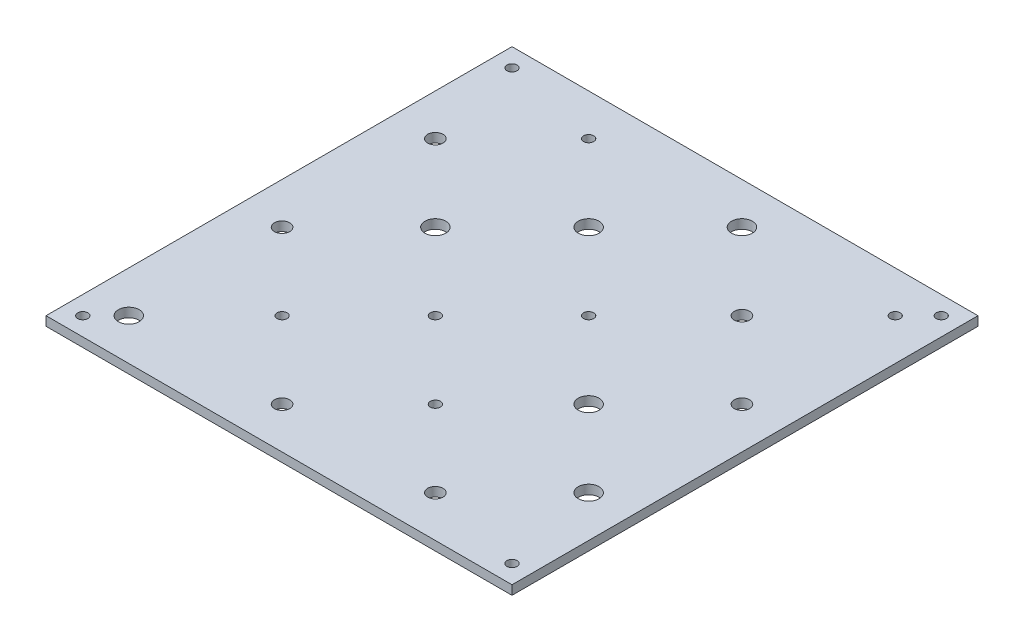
ISO-10303-21;
HEADER;
FILE_DESCRIPTION(('STEP AP214'),'2;1');
FILE_NAME('part.step','',(''),(''),'','','');
FILE_SCHEMA(('AUTOMOTIVE_DESIGN { 1 0 10303 214 1 1 1 1 }'));
ENDSEC;
DATA;
#1=APPLICATION_CONTEXT('core data for automotive mechanical design processes');
#2=APPLICATION_PROTOCOL_DEFINITION('international standard','automotive_design',2000,#1);
#3=PRODUCT_CONTEXT('',#1,'mechanical');
#4=PRODUCT('Part','Part','',(#3));
#5=PRODUCT_RELATED_PRODUCT_CATEGORY('part','',(#4));
#6=PRODUCT_DEFINITION_FORMATION('','',#4);
#7=PRODUCT_DEFINITION_CONTEXT('part definition',#1,'design');
#8=PRODUCT_DEFINITION('design','',#6,#7);
#9=PRODUCT_DEFINITION_SHAPE('','',#8);
#10=(LENGTH_UNIT() NAMED_UNIT(*) SI_UNIT(.MILLI.,.METRE.));
#11=(NAMED_UNIT(*) PLANE_ANGLE_UNIT() SI_UNIT($,.RADIAN.));
#12=(NAMED_UNIT(*) SI_UNIT($,.STERADIAN.) SOLID_ANGLE_UNIT());
#13=UNCERTAINTY_MEASURE_WITH_UNIT(LENGTH_MEASURE(1.E-05),#10,'distance_accuracy_value','');
#14=(GEOMETRIC_REPRESENTATION_CONTEXT(3) GLOBAL_UNCERTAINTY_ASSIGNED_CONTEXT((#13)) GLOBAL_UNIT_ASSIGNED_CONTEXT((#10,
#11,#12)) REPRESENTATION_CONTEXT('',''));
#15=CARTESIAN_POINT('',(0.,0.,0.));
#16=DIRECTION('',(0.,0.,1.));
#17=DIRECTION('',(1.,0.,0.));
#18=AXIS2_PLACEMENT_3D('',#15,#16,#17);
#19=CARTESIAN_POINT('',(76.,3.,76.));
#20=DIRECTION('',(-1.,0.,0.));
#21=DIRECTION('',(0.,0.,1.));
#22=AXIS2_PLACEMENT_3D('',#19,#20,#21);
#23=PLANE('',#22);
#24=DIRECTION('',(0.,0.,-1.));
#25=VECTOR('',#24,1.);
#26=CARTESIAN_POINT('',(76.,0.,76.));
#27=LINE('',#26,#25);
#28=CARTESIAN_POINT('',(76.,0.,76.));
#29=VERTEX_POINT('',#28);
#30=CARTESIAN_POINT('',(76.,0.,-76.));
#31=VERTEX_POINT('',#30);
#32=EDGE_CURVE('E107',#29,#31,#27,.T.);
#33=ORIENTED_EDGE('',*,*,#32,.T.);
#34=DIRECTION('',(0.,-1.,0.));
#35=VECTOR('',#34,1.);
#36=CARTESIAN_POINT('',(76.,3.,-76.));
#37=LINE('',#36,#35);
#38=CARTESIAN_POINT('',(76.,3.,-76.));
#39=VERTEX_POINT('',#38);
#40=EDGE_CURVE('E11',#39,#31,#37,.T.);
#41=ORIENTED_EDGE('',*,*,#40,.F.);
#42=DIRECTION('',(0.,0.,-1.));
#43=VECTOR('',#42,1.);
#44=CARTESIAN_POINT('',(76.,3.,76.));
#45=LINE('',#44,#43);
#46=CARTESIAN_POINT('',(76.,3.,76.));
#47=VERTEX_POINT('',#46);
#48=EDGE_CURVE('E91',#47,#39,#45,.T.);
#49=ORIENTED_EDGE('',*,*,#48,.F.);
#50=DIRECTION('',(0.,-1.,0.));
#51=VECTOR('',#50,1.);
#52=CARTESIAN_POINT('',(76.,3.,76.));
#53=LINE('',#52,#51);
#54=EDGE_CURVE('E103',#47,#29,#53,.T.);
#55=ORIENTED_EDGE('',*,*,#54,.T.);
#56=EDGE_LOOP('',(#33,#41,#49,#55));
#57=FACE_BOUND('',#56,.T.);
#58=ADVANCED_FACE('F39',(#57),#23,.F.);
#59=CARTESIAN_POINT('',(-76.,3.,-76.));
#60=DIRECTION('',(0.,0.,1.));
#61=DIRECTION('',(1.,0.,0.));
#62=AXIS2_PLACEMENT_3D('',#59,#60,#61);
#63=PLANE('',#62);
#64=DIRECTION('',(-1.,0.,0.));
#65=VECTOR('',#64,1.);
#66=CARTESIAN_POINT('',(-76.,0.,-76.));
#67=LINE('',#66,#65);
#68=CARTESIAN_POINT('',(-76.,0.,-76.));
#69=VERTEX_POINT('',#68);
#70=EDGE_CURVE('E96',#31,#69,#67,.T.);
#71=ORIENTED_EDGE('',*,*,#70,.T.);
#72=DIRECTION('',(0.,-1.,0.));
#73=VECTOR('',#72,1.);
#74=CARTESIAN_POINT('',(-76.,3.,-76.));
#75=LINE('',#74,#73);
#76=CARTESIAN_POINT('',(-76.,3.,-76.));
#77=VERTEX_POINT('',#76);
#78=EDGE_CURVE('E48',#77,#69,#75,.T.);
#79=ORIENTED_EDGE('',*,*,#78,.F.);
#80=DIRECTION('',(-1.,0.,0.));
#81=VECTOR('',#80,1.);
#82=CARTESIAN_POINT('',(-76.,3.,-76.));
#83=LINE('',#82,#81);
#84=EDGE_CURVE('E86',#39,#77,#83,.T.);
#85=ORIENTED_EDGE('',*,*,#84,.F.);
#86=ORIENTED_EDGE('',*,*,#40,.T.);
#87=EDGE_LOOP('',(#71,#79,#85,#86));
#88=FACE_BOUND('',#87,.T.);
#89=ADVANCED_FACE('F95',(#88),#63,.F.);
#90=CARTESIAN_POINT('',(-76.,3.,76.));
#91=DIRECTION('',(1.,0.,0.));
#92=DIRECTION('',(0.,0.,-1.));
#93=AXIS2_PLACEMENT_3D('',#90,#91,#92);
#94=PLANE('',#93);
#95=DIRECTION('',(0.,0.,1.));
#96=VECTOR('',#95,1.);
#97=CARTESIAN_POINT('',(-76.,0.,76.));
#98=LINE('',#97,#96);
#99=CARTESIAN_POINT('',(-76.,0.,76.));
#100=VERTEX_POINT('',#99);
#101=EDGE_CURVE('E73',#69,#100,#98,.T.);
#102=ORIENTED_EDGE('',*,*,#101,.T.);
#103=DIRECTION('',(0.,-1.,0.));
#104=VECTOR('',#103,1.);
#105=CARTESIAN_POINT('',(-76.,3.,76.));
#106=LINE('',#105,#104);
#107=CARTESIAN_POINT('',(-76.,3.,76.));
#108=VERTEX_POINT('',#107);
#109=EDGE_CURVE('E98',#108,#100,#106,.T.);
#110=ORIENTED_EDGE('',*,*,#109,.F.);
#111=DIRECTION('',(0.,0.,1.));
#112=VECTOR('',#111,1.);
#113=CARTESIAN_POINT('',(-76.,3.,76.));
#114=LINE('',#113,#112);
#115=EDGE_CURVE('E89',#77,#108,#114,.T.);
#116=ORIENTED_EDGE('',*,*,#115,.F.);
#117=ORIENTED_EDGE('',*,*,#78,.T.);
#118=EDGE_LOOP('',(#102,#110,#116,#117));
#119=FACE_BOUND('',#118,.T.);
#120=ADVANCED_FACE('F99',(#119),#94,.F.);
#121=CARTESIAN_POINT('',(-76.,3.,76.));
#122=DIRECTION('',(0.,0.,-1.));
#123=DIRECTION('',(-1.,0.,0.));
#124=AXIS2_PLACEMENT_3D('',#121,#122,#123);
#125=PLANE('',#124);
#126=DIRECTION('',(1.,0.,0.));
#127=VECTOR('',#126,1.);
#128=CARTESIAN_POINT('',(-76.,0.,76.));
#129=LINE('',#128,#127);
#130=EDGE_CURVE('E79',#100,#29,#129,.T.);
#131=ORIENTED_EDGE('',*,*,#130,.T.);
#132=ORIENTED_EDGE('',*,*,#54,.F.);
#133=DIRECTION('',(1.,0.,0.));
#134=VECTOR('',#133,1.);
#135=CARTESIAN_POINT('',(-76.,3.,76.));
#136=LINE('',#135,#134);
#137=EDGE_CURVE('E56',#108,#47,#136,.T.);
#138=ORIENTED_EDGE('',*,*,#137,.F.);
#139=ORIENTED_EDGE('',*,*,#109,.T.);
#140=EDGE_LOOP('',(#131,#132,#138,#139));
#141=FACE_BOUND('',#140,.T.);
#142=ADVANCED_FACE('F121',(#141),#125,.F.);
#143=CARTESIAN_POINT('',(0.,3.,0.));
#144=DIRECTION('',(0.,-1.,0.));
#145=DIRECTION('',(0.,0.,-1.));
#146=AXIS2_PLACEMENT_3D('',#143,#144,#145);
#147=PLANE('',#146);
#148=CARTESIAN_POINT('',(-70.,3.,-70.));
#149=DIRECTION('',(0.,1.,0.));
#150=DIRECTION('',(0.,0.,1.));
#151=AXIS2_PLACEMENT_3D('',#148,#149,#150);
#152=CIRCLE('',#151,1.65);
#153=CARTESIAN_POINT('',(-70.,3.,-68.35));
#154=VERTEX_POINT('',#153);
#155=EDGE_CURVE('E299',#154,#154,#152,.T.);
#156=ORIENTED_EDGE('',*,*,#155,.F.);
#157=EDGE_LOOP('',(#156));
#158=FACE_BOUND('',#157,.T.);
#159=CARTESIAN_POINT('',(70.,3.,-70.));
#160=DIRECTION('',(0.,1.,0.));
#161=DIRECTION('',(0.,0.,1.));
#162=AXIS2_PLACEMENT_3D('',#159,#160,#161);
#163=CIRCLE('',#162,1.65);
#164=CARTESIAN_POINT('',(70.,3.,-68.35));
#165=VERTEX_POINT('',#164);
#166=EDGE_CURVE('E291',#165,#165,#163,.T.);
#167=ORIENTED_EDGE('',*,*,#166,.F.);
#168=EDGE_LOOP('',(#167));
#169=FACE_BOUND('',#168,.T.);
#170=CARTESIAN_POINT('',(-70.,3.,70.));
#171=DIRECTION('',(0.,1.,0.));
#172=DIRECTION('',(0.,0.,1.));
#173=AXIS2_PLACEMENT_3D('',#170,#171,#172);
#174=CIRCLE('',#173,1.65);
#175=CARTESIAN_POINT('',(-70.,3.,71.65));
#176=VERTEX_POINT('',#175);
#177=EDGE_CURVE('E283',#176,#176,#174,.T.);
#178=ORIENTED_EDGE('',*,*,#177,.F.);
#179=EDGE_LOOP('',(#178));
#180=FACE_BOUND('',#179,.T.);
#181=CARTESIAN_POINT('',(70.,3.,70.));
#182=DIRECTION('',(0.,1.,0.));
#183=DIRECTION('',(0.,0.,1.));
#184=AXIS2_PLACEMENT_3D('',#181,#182,#183);
#185=CIRCLE('',#184,1.65);
#186=CARTESIAN_POINT('',(70.,3.,71.65));
#187=VERTEX_POINT('',#186);
#188=EDGE_CURVE('E275',#187,#187,#185,.T.);
#189=ORIENTED_EDGE('',*,*,#188,.F.);
#190=EDGE_LOOP('',(#189));
#191=FACE_BOUND('',#190,.T.);
#192=CARTESIAN_POINT('',(62.5,3.,37.5));
#193=DIRECTION('',(0.,1.,0.));
#194=DIRECTION('',(0.,0.,1.));
#195=AXIS2_PLACEMENT_3D('',#192,#193,#194);
#196=CIRCLE('',#195,3.4);
#197=CARTESIAN_POINT('',(62.5,3.,40.9));
#198=VERTEX_POINT('',#197);
#199=EDGE_CURVE('E267',#198,#198,#196,.T.);
#200=ORIENTED_EDGE('',*,*,#199,.F.);
#201=EDGE_LOOP('',(#200));
#202=FACE_BOUND('',#201,.T.);
#203=CARTESIAN_POINT('',(37.5,3.,12.5));
#204=DIRECTION('',(0.,1.,0.));
#205=DIRECTION('',(0.,0.,1.));
#206=AXIS2_PLACEMENT_3D('',#203,#204,#205);
#207=CIRCLE('',#206,3.4);
#208=CARTESIAN_POINT('',(37.5,3.,15.9));
#209=VERTEX_POINT('',#208);
#210=EDGE_CURVE('E259',#209,#209,#207,.T.);
#211=ORIENTED_EDGE('',*,*,#210,.F.);
#212=EDGE_LOOP('',(#211));
#213=FACE_BOUND('',#212,.T.);
#214=CARTESIAN_POINT('',(-12.5,3.,-37.5));
#215=DIRECTION('',(0.,1.,0.));
#216=DIRECTION('',(0.,0.,1.));
#217=AXIS2_PLACEMENT_3D('',#214,#215,#216);
#218=CIRCLE('',#217,3.4);
#219=CARTESIAN_POINT('',(-12.5,3.,-34.1));
#220=VERTEX_POINT('',#219);
#221=EDGE_CURVE('E251',#220,#220,#218,.T.);
#222=ORIENTED_EDGE('',*,*,#221,.F.);
#223=EDGE_LOOP('',(#222));
#224=FACE_BOUND('',#223,.T.);
#225=CARTESIAN_POINT('',(12.5,3.,-62.5));
#226=DIRECTION('',(0.,1.,0.));
#227=DIRECTION('',(0.,0.,1.));
#228=AXIS2_PLACEMENT_3D('',#225,#226,#227);
#229=CIRCLE('',#228,3.4);
#230=CARTESIAN_POINT('',(12.5,3.,-59.1));
#231=VERTEX_POINT('',#230);
#232=EDGE_CURVE('E243',#231,#231,#229,.T.);
#233=ORIENTED_EDGE('',*,*,#232,.F.);
#234=EDGE_LOOP('',(#233));
#235=FACE_BOUND('',#234,.T.);
#236=CARTESIAN_POINT('',(-62.5,3.,62.5));
#237=DIRECTION('',(0.,1.,0.));
#238=DIRECTION('',(0.,0.,1.));
#239=AXIS2_PLACEMENT_3D('',#236,#237,#238);
#240=CIRCLE('',#239,3.4);
#241=CARTESIAN_POINT('',(-62.5,3.,65.9));
#242=VERTEX_POINT('',#241);
#243=EDGE_CURVE('E235',#242,#242,#240,.T.);
#244=ORIENTED_EDGE('',*,*,#243,.F.);
#245=EDGE_LOOP('',(#244));
#246=FACE_BOUND('',#245,.T.);
#247=CARTESIAN_POINT('',(-37.5,3.,-12.5));
#248=DIRECTION('',(0.,1.,0.));
#249=DIRECTION('',(0.,0.,1.));
#250=AXIS2_PLACEMENT_3D('',#247,#248,#249);
#251=CIRCLE('',#250,3.4);
#252=CARTESIAN_POINT('',(-37.5,3.,-9.1));
#253=VERTEX_POINT('',#252);
#254=EDGE_CURVE('E227',#253,#253,#251,.T.);
#255=ORIENTED_EDGE('',*,*,#254,.F.);
#256=EDGE_LOOP('',(#255));
#257=FACE_BOUND('',#256,.T.);
#258=CARTESIAN_POINT('',(37.5,3.,-37.5));
#259=DIRECTION('',(0.,1.,0.));
#260=DIRECTION('',(0.,0.,1.));
#261=AXIS2_PLACEMENT_3D('',#258,#259,#260);
#262=CIRCLE('',#261,2.5);
#263=CARTESIAN_POINT('',(37.5,3.,-35.));
#264=VERTEX_POINT('',#263);
#265=EDGE_CURVE('E219',#264,#264,#262,.T.);
#266=ORIENTED_EDGE('',*,*,#265,.F.);
#267=EDGE_LOOP('',(#266));
#268=FACE_BOUND('',#267,.T.);
#269=CARTESIAN_POINT('',(-62.5,3.,-37.5));
#270=DIRECTION('',(0.,1.,0.));
#271=DIRECTION('',(0.,0.,1.));
#272=AXIS2_PLACEMENT_3D('',#269,#270,#271);
#273=CIRCLE('',#272,2.5);
#274=CARTESIAN_POINT('',(-62.5,3.,-35.));
#275=VERTEX_POINT('',#274);
#276=EDGE_CURVE('E211',#275,#275,#273,.T.);
#277=ORIENTED_EDGE('',*,*,#276,.F.);
#278=EDGE_LOOP('',(#277));
#279=FACE_BOUND('',#278,.T.);
#280=CARTESIAN_POINT('',(62.5,3.,-12.5));
#281=DIRECTION('',(0.,1.,0.));
#282=DIRECTION('',(0.,0.,1.));
#283=AXIS2_PLACEMENT_3D('',#280,#281,#282);
#284=CIRCLE('',#283,2.5);
#285=CARTESIAN_POINT('',(62.5,3.,-10.));
#286=VERTEX_POINT('',#285);
#287=EDGE_CURVE('E203',#286,#286,#284,.T.);
#288=ORIENTED_EDGE('',*,*,#287,.F.);
#289=EDGE_LOOP('',(#288));
#290=FACE_BOUND('',#289,.T.);
#291=CARTESIAN_POINT('',(37.5,3.,62.5));
#292=DIRECTION('',(0.,1.,0.));
#293=DIRECTION('',(0.,0.,1.));
#294=AXIS2_PLACEMENT_3D('',#291,#292,#293);
#295=CIRCLE('',#294,2.5);
#296=CARTESIAN_POINT('',(37.5,3.,65.));
#297=VERTEX_POINT('',#296);
#298=EDGE_CURVE('E195',#297,#297,#295,.T.);
#299=ORIENTED_EDGE('',*,*,#298,.F.);
#300=EDGE_LOOP('',(#299));
#301=FACE_BOUND('',#300,.T.);
#302=CARTESIAN_POINT('',(-12.5,3.,62.5));
#303=DIRECTION('',(0.,1.,0.));
#304=DIRECTION('',(0.,0.,1.));
#305=AXIS2_PLACEMENT_3D('',#302,#303,#304);
#306=CIRCLE('',#305,2.5);
#307=CARTESIAN_POINT('',(-12.5,3.,65.));
#308=VERTEX_POINT('',#307);
#309=EDGE_CURVE('E187',#308,#308,#306,.T.);
#310=ORIENTED_EDGE('',*,*,#309,.F.);
#311=EDGE_LOOP('',(#310));
#312=FACE_BOUND('',#311,.T.);
#313=CARTESIAN_POINT('',(-62.5,3.,12.5));
#314=DIRECTION('',(0.,1.,0.));
#315=DIRECTION('',(0.,0.,1.));
#316=AXIS2_PLACEMENT_3D('',#313,#314,#315);
#317=CIRCLE('',#316,2.5);
#318=CARTESIAN_POINT('',(-62.5,3.,15.));
#319=VERTEX_POINT('',#318);
#320=EDGE_CURVE('E179',#319,#319,#317,.T.);
#321=ORIENTED_EDGE('',*,*,#320,.F.);
#322=EDGE_LOOP('',(#321));
#323=FACE_BOUND('',#322,.T.);
#324=CARTESIAN_POINT('',(-37.5,3.,-62.5));
#325=DIRECTION('',(0.,1.,0.));
#326=DIRECTION('',(0.,0.,1.));
#327=AXIS2_PLACEMENT_3D('',#324,#325,#326);
#328=CIRCLE('',#327,1.65);
#329=CARTESIAN_POINT('',(-37.5,3.,-60.85));
#330=VERTEX_POINT('',#329);
#331=EDGE_CURVE('E171',#330,#330,#328,.T.);
#332=ORIENTED_EDGE('',*,*,#331,.F.);
#333=EDGE_LOOP('',(#332));
#334=FACE_BOUND('',#333,.T.);
#335=CARTESIAN_POINT('',(62.5,3.,-62.5));
#336=DIRECTION('',(0.,1.,0.));
#337=DIRECTION('',(0.,0.,1.));
#338=AXIS2_PLACEMENT_3D('',#335,#336,#337);
#339=CIRCLE('',#338,1.65000000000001);
#340=CARTESIAN_POINT('',(62.5,3.,-60.85));
#341=VERTEX_POINT('',#340);
#342=EDGE_CURVE('E163',#341,#341,#339,.T.);
#343=ORIENTED_EDGE('',*,*,#342,.F.);
#344=EDGE_LOOP('',(#343));
#345=FACE_BOUND('',#344,.T.);
#346=CARTESIAN_POINT('',(12.5,3.,-12.5));
#347=DIRECTION('',(0.,1.,0.));
#348=DIRECTION('',(0.,0.,1.));
#349=AXIS2_PLACEMENT_3D('',#346,#347,#348);
#350=CIRCLE('',#349,1.65);
#351=CARTESIAN_POINT('',(12.5,3.,-10.85));
#352=VERTEX_POINT('',#351);
#353=EDGE_CURVE('E155',#352,#352,#350,.T.);
#354=ORIENTED_EDGE('',*,*,#353,.F.);
#355=EDGE_LOOP('',(#354));
#356=FACE_BOUND('',#355,.T.);
#357=CARTESIAN_POINT('',(-37.5,3.,37.5));
#358=DIRECTION('',(0.,1.,0.));
#359=DIRECTION('',(0.,0.,1.));
#360=AXIS2_PLACEMENT_3D('',#357,#358,#359);
#361=CIRCLE('',#360,1.65);
#362=CARTESIAN_POINT('',(-37.5,3.,39.15));
#363=VERTEX_POINT('',#362);
#364=EDGE_CURVE('E147',#363,#363,#361,.T.);
#365=ORIENTED_EDGE('',*,*,#364,.F.);
#366=EDGE_LOOP('',(#365));
#367=FACE_BOUND('',#366,.T.);
#368=CARTESIAN_POINT('',(-12.5,3.,12.5));
#369=DIRECTION('',(0.,1.,0.));
#370=DIRECTION('',(0.,0.,1.));
#371=AXIS2_PLACEMENT_3D('',#368,#369,#370);
#372=CIRCLE('',#371,1.65);
#373=CARTESIAN_POINT('',(-12.5,3.,14.15));
#374=VERTEX_POINT('',#373);
#375=EDGE_CURVE('E139',#374,#374,#372,.T.);
#376=ORIENTED_EDGE('',*,*,#375,.F.);
#377=EDGE_LOOP('',(#376));
#378=FACE_BOUND('',#377,.T.);
#379=CARTESIAN_POINT('',(12.5,3.,37.5));
#380=DIRECTION('',(0.,1.,0.));
#381=DIRECTION('',(0.,0.,1.));
#382=AXIS2_PLACEMENT_3D('',#379,#380,#381);
#383=CIRCLE('',#382,1.65);
#384=CARTESIAN_POINT('',(12.5,3.,39.15));
#385=VERTEX_POINT('',#384);
#386=EDGE_CURVE('E131',#385,#385,#383,.T.);
#387=ORIENTED_EDGE('',*,*,#386,.F.);
#388=EDGE_LOOP('',(#387));
#389=FACE_BOUND('',#388,.T.);
#390=ORIENTED_EDGE('',*,*,#48,.T.);
#391=ORIENTED_EDGE('',*,*,#84,.T.);
#392=ORIENTED_EDGE('',*,*,#115,.T.);
#393=ORIENTED_EDGE('',*,*,#137,.T.);
#394=EDGE_LOOP('',(#390,#391,#392,#393));
#395=FACE_BOUND('',#394,.T.);
#396=ADVANCED_FACE('F87',(#158,#169,#180,#191,#202,#213,#224,#235,#246,#257,#268,#279,#290,#301,
#312,#323,#334,#345,#356,#367,#378,#389,#395),#147,.F.);
#397=CARTESIAN_POINT('',(0.,0.,0.));
#398=DIRECTION('',(0.,-1.,0.));
#399=DIRECTION('',(0.,0.,-1.));
#400=AXIS2_PLACEMENT_3D('',#397,#398,#399);
#401=PLANE('',#400);
#402=CARTESIAN_POINT('',(-70.,0.,-70.));
#403=DIRECTION('',(0.,1.,0.));
#404=DIRECTION('',(0.,0.,1.));
#405=AXIS2_PLACEMENT_3D('',#402,#403,#404);
#406=CIRCLE('',#405,1.65);
#407=CARTESIAN_POINT('',(-70.,0.,-68.35));
#408=VERTEX_POINT('',#407);
#409=EDGE_CURVE('E295',#408,#408,#406,.T.);
#410=ORIENTED_EDGE('',*,*,#409,.T.);
#411=EDGE_LOOP('',(#410));
#412=FACE_BOUND('',#411,.T.);
#413=CARTESIAN_POINT('',(70.,0.,-70.));
#414=DIRECTION('',(0.,1.,0.));
#415=DIRECTION('',(0.,0.,1.));
#416=AXIS2_PLACEMENT_3D('',#413,#414,#415);
#417=CIRCLE('',#416,1.65);
#418=CARTESIAN_POINT('',(70.,0.,-68.35));
#419=VERTEX_POINT('',#418);
#420=EDGE_CURVE('E287',#419,#419,#417,.T.);
#421=ORIENTED_EDGE('',*,*,#420,.T.);
#422=EDGE_LOOP('',(#421));
#423=FACE_BOUND('',#422,.T.);
#424=CARTESIAN_POINT('',(-70.,0.,70.));
#425=DIRECTION('',(0.,1.,0.));
#426=DIRECTION('',(0.,0.,1.));
#427=AXIS2_PLACEMENT_3D('',#424,#425,#426);
#428=CIRCLE('',#427,1.65);
#429=CARTESIAN_POINT('',(-70.,0.,71.65));
#430=VERTEX_POINT('',#429);
#431=EDGE_CURVE('E279',#430,#430,#428,.T.);
#432=ORIENTED_EDGE('',*,*,#431,.T.);
#433=EDGE_LOOP('',(#432));
#434=FACE_BOUND('',#433,.T.);
#435=CARTESIAN_POINT('',(70.,0.,70.));
#436=DIRECTION('',(0.,1.,0.));
#437=DIRECTION('',(0.,0.,1.));
#438=AXIS2_PLACEMENT_3D('',#435,#436,#437);
#439=CIRCLE('',#438,1.65);
#440=CARTESIAN_POINT('',(70.,0.,71.65));
#441=VERTEX_POINT('',#440);
#442=EDGE_CURVE('E271',#441,#441,#439,.T.);
#443=ORIENTED_EDGE('',*,*,#442,.T.);
#444=EDGE_LOOP('',(#443));
#445=FACE_BOUND('',#444,.T.);
#446=CARTESIAN_POINT('',(62.5,0.,37.5));
#447=DIRECTION('',(0.,1.,0.));
#448=DIRECTION('',(0.,0.,1.));
#449=AXIS2_PLACEMENT_3D('',#446,#447,#448);
#450=CIRCLE('',#449,3.4);
#451=CARTESIAN_POINT('',(62.5,0.,40.9));
#452=VERTEX_POINT('',#451);
#453=EDGE_CURVE('E263',#452,#452,#450,.T.);
#454=ORIENTED_EDGE('',*,*,#453,.T.);
#455=EDGE_LOOP('',(#454));
#456=FACE_BOUND('',#455,.T.);
#457=CARTESIAN_POINT('',(37.5,0.,12.5));
#458=DIRECTION('',(0.,1.,0.));
#459=DIRECTION('',(0.,0.,1.));
#460=AXIS2_PLACEMENT_3D('',#457,#458,#459);
#461=CIRCLE('',#460,3.4);
#462=CARTESIAN_POINT('',(37.5,0.,15.9));
#463=VERTEX_POINT('',#462);
#464=EDGE_CURVE('E255',#463,#463,#461,.T.);
#465=ORIENTED_EDGE('',*,*,#464,.T.);
#466=EDGE_LOOP('',(#465));
#467=FACE_BOUND('',#466,.T.);
#468=CARTESIAN_POINT('',(-12.5,0.,-37.5));
#469=DIRECTION('',(0.,1.,0.));
#470=DIRECTION('',(0.,0.,1.));
#471=AXIS2_PLACEMENT_3D('',#468,#469,#470);
#472=CIRCLE('',#471,3.4);
#473=CARTESIAN_POINT('',(-12.5,0.,-34.1));
#474=VERTEX_POINT('',#473);
#475=EDGE_CURVE('E247',#474,#474,#472,.T.);
#476=ORIENTED_EDGE('',*,*,#475,.T.);
#477=EDGE_LOOP('',(#476));
#478=FACE_BOUND('',#477,.T.);
#479=CARTESIAN_POINT('',(12.5,0.,-62.5));
#480=DIRECTION('',(0.,1.,0.));
#481=DIRECTION('',(0.,0.,1.));
#482=AXIS2_PLACEMENT_3D('',#479,#480,#481);
#483=CIRCLE('',#482,3.4);
#484=CARTESIAN_POINT('',(12.5,0.,-59.1));
#485=VERTEX_POINT('',#484);
#486=EDGE_CURVE('E239',#485,#485,#483,.T.);
#487=ORIENTED_EDGE('',*,*,#486,.T.);
#488=EDGE_LOOP('',(#487));
#489=FACE_BOUND('',#488,.T.);
#490=CARTESIAN_POINT('',(-62.5,0.,62.5));
#491=DIRECTION('',(0.,1.,0.));
#492=DIRECTION('',(0.,0.,1.));
#493=AXIS2_PLACEMENT_3D('',#490,#491,#492);
#494=CIRCLE('',#493,3.4);
#495=CARTESIAN_POINT('',(-62.5,0.,65.9));
#496=VERTEX_POINT('',#495);
#497=EDGE_CURVE('E231',#496,#496,#494,.T.);
#498=ORIENTED_EDGE('',*,*,#497,.T.);
#499=EDGE_LOOP('',(#498));
#500=FACE_BOUND('',#499,.T.);
#501=CARTESIAN_POINT('',(-37.5,0.,-12.5));
#502=DIRECTION('',(0.,1.,0.));
#503=DIRECTION('',(0.,0.,1.));
#504=AXIS2_PLACEMENT_3D('',#501,#502,#503);
#505=CIRCLE('',#504,3.4);
#506=CARTESIAN_POINT('',(-37.5,0.,-9.1));
#507=VERTEX_POINT('',#506);
#508=EDGE_CURVE('E223',#507,#507,#505,.T.);
#509=ORIENTED_EDGE('',*,*,#508,.T.);
#510=EDGE_LOOP('',(#509));
#511=FACE_BOUND('',#510,.T.);
#512=CARTESIAN_POINT('',(37.5,0.,-37.5));
#513=DIRECTION('',(0.,1.,0.));
#514=DIRECTION('',(0.,0.,1.));
#515=AXIS2_PLACEMENT_3D('',#512,#513,#514);
#516=CIRCLE('',#515,2.5);
#517=CARTESIAN_POINT('',(37.5,0.,-35.));
#518=VERTEX_POINT('',#517);
#519=EDGE_CURVE('E215',#518,#518,#516,.T.);
#520=ORIENTED_EDGE('',*,*,#519,.T.);
#521=EDGE_LOOP('',(#520));
#522=FACE_BOUND('',#521,.T.);
#523=CARTESIAN_POINT('',(-62.5,0.,-37.5));
#524=DIRECTION('',(0.,1.,0.));
#525=DIRECTION('',(0.,0.,1.));
#526=AXIS2_PLACEMENT_3D('',#523,#524,#525);
#527=CIRCLE('',#526,2.5);
#528=CARTESIAN_POINT('',(-62.5,0.,-35.));
#529=VERTEX_POINT('',#528);
#530=EDGE_CURVE('E207',#529,#529,#527,.T.);
#531=ORIENTED_EDGE('',*,*,#530,.T.);
#532=EDGE_LOOP('',(#531));
#533=FACE_BOUND('',#532,.T.);
#534=CARTESIAN_POINT('',(62.5,0.,-12.5));
#535=DIRECTION('',(0.,1.,0.));
#536=DIRECTION('',(0.,0.,1.));
#537=AXIS2_PLACEMENT_3D('',#534,#535,#536);
#538=CIRCLE('',#537,2.5);
#539=CARTESIAN_POINT('',(62.5,0.,-10.));
#540=VERTEX_POINT('',#539);
#541=EDGE_CURVE('E199',#540,#540,#538,.T.);
#542=ORIENTED_EDGE('',*,*,#541,.T.);
#543=EDGE_LOOP('',(#542));
#544=FACE_BOUND('',#543,.T.);
#545=CARTESIAN_POINT('',(37.5,0.,62.5));
#546=DIRECTION('',(0.,1.,0.));
#547=DIRECTION('',(0.,0.,1.));
#548=AXIS2_PLACEMENT_3D('',#545,#546,#547);
#549=CIRCLE('',#548,2.5);
#550=CARTESIAN_POINT('',(37.5,0.,65.));
#551=VERTEX_POINT('',#550);
#552=EDGE_CURVE('E191',#551,#551,#549,.T.);
#553=ORIENTED_EDGE('',*,*,#552,.T.);
#554=EDGE_LOOP('',(#553));
#555=FACE_BOUND('',#554,.T.);
#556=CARTESIAN_POINT('',(-12.5,0.,62.5));
#557=DIRECTION('',(0.,1.,0.));
#558=DIRECTION('',(0.,0.,1.));
#559=AXIS2_PLACEMENT_3D('',#556,#557,#558);
#560=CIRCLE('',#559,2.5);
#561=CARTESIAN_POINT('',(-12.5,0.,65.));
#562=VERTEX_POINT('',#561);
#563=EDGE_CURVE('E183',#562,#562,#560,.T.);
#564=ORIENTED_EDGE('',*,*,#563,.T.);
#565=EDGE_LOOP('',(#564));
#566=FACE_BOUND('',#565,.T.);
#567=CARTESIAN_POINT('',(-62.5,0.,12.5));
#568=DIRECTION('',(0.,1.,0.));
#569=DIRECTION('',(0.,0.,1.));
#570=AXIS2_PLACEMENT_3D('',#567,#568,#569);
#571=CIRCLE('',#570,2.5);
#572=CARTESIAN_POINT('',(-62.5,0.,15.));
#573=VERTEX_POINT('',#572);
#574=EDGE_CURVE('E175',#573,#573,#571,.T.);
#575=ORIENTED_EDGE('',*,*,#574,.T.);
#576=EDGE_LOOP('',(#575));
#577=FACE_BOUND('',#576,.T.);
#578=CARTESIAN_POINT('',(-37.5,0.,-62.5));
#579=DIRECTION('',(0.,1.,0.));
#580=DIRECTION('',(0.,0.,1.));
#581=AXIS2_PLACEMENT_3D('',#578,#579,#580);
#582=CIRCLE('',#581,1.65);
#583=CARTESIAN_POINT('',(-37.5,0.,-60.85));
#584=VERTEX_POINT('',#583);
#585=EDGE_CURVE('E167',#584,#584,#582,.T.);
#586=ORIENTED_EDGE('',*,*,#585,.T.);
#587=EDGE_LOOP('',(#586));
#588=FACE_BOUND('',#587,.T.);
#589=CARTESIAN_POINT('',(62.5,0.,-62.5));
#590=DIRECTION('',(0.,1.,0.));
#591=DIRECTION('',(0.,0.,1.));
#592=AXIS2_PLACEMENT_3D('',#589,#590,#591);
#593=CIRCLE('',#592,1.65000000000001);
#594=CARTESIAN_POINT('',(62.5,0.,-60.85));
#595=VERTEX_POINT('',#594);
#596=EDGE_CURVE('E159',#595,#595,#593,.T.);
#597=ORIENTED_EDGE('',*,*,#596,.T.);
#598=EDGE_LOOP('',(#597));
#599=FACE_BOUND('',#598,.T.);
#600=CARTESIAN_POINT('',(12.5,0.,-12.5));
#601=DIRECTION('',(0.,1.,0.));
#602=DIRECTION('',(0.,0.,1.));
#603=AXIS2_PLACEMENT_3D('',#600,#601,#602);
#604=CIRCLE('',#603,1.65);
#605=CARTESIAN_POINT('',(12.5,0.,-10.85));
#606=VERTEX_POINT('',#605);
#607=EDGE_CURVE('E151',#606,#606,#604,.T.);
#608=ORIENTED_EDGE('',*,*,#607,.T.);
#609=EDGE_LOOP('',(#608));
#610=FACE_BOUND('',#609,.T.);
#611=CARTESIAN_POINT('',(-37.5,0.,37.5));
#612=DIRECTION('',(0.,1.,0.));
#613=DIRECTION('',(0.,0.,1.));
#614=AXIS2_PLACEMENT_3D('',#611,#612,#613);
#615=CIRCLE('',#614,1.65);
#616=CARTESIAN_POINT('',(-37.5,0.,39.15));
#617=VERTEX_POINT('',#616);
#618=EDGE_CURVE('E143',#617,#617,#615,.T.);
#619=ORIENTED_EDGE('',*,*,#618,.T.);
#620=EDGE_LOOP('',(#619));
#621=FACE_BOUND('',#620,.T.);
#622=CARTESIAN_POINT('',(-12.5,0.,12.5));
#623=DIRECTION('',(0.,1.,0.));
#624=DIRECTION('',(0.,0.,1.));
#625=AXIS2_PLACEMENT_3D('',#622,#623,#624);
#626=CIRCLE('',#625,1.65);
#627=CARTESIAN_POINT('',(-12.5,0.,14.15));
#628=VERTEX_POINT('',#627);
#629=EDGE_CURVE('E135',#628,#628,#626,.T.);
#630=ORIENTED_EDGE('',*,*,#629,.T.);
#631=EDGE_LOOP('',(#630));
#632=FACE_BOUND('',#631,.T.);
#633=CARTESIAN_POINT('',(12.5,0.,37.5));
#634=DIRECTION('',(0.,1.,0.));
#635=DIRECTION('',(0.,0.,1.));
#636=AXIS2_PLACEMENT_3D('',#633,#634,#635);
#637=CIRCLE('',#636,1.65);
#638=CARTESIAN_POINT('',(12.5,0.,39.15));
#639=VERTEX_POINT('',#638);
#640=EDGE_CURVE('E111',#639,#639,#637,.T.);
#641=ORIENTED_EDGE('',*,*,#640,.T.);
#642=EDGE_LOOP('',(#641));
#643=FACE_BOUND('',#642,.T.);
#644=ORIENTED_EDGE('',*,*,#32,.F.);
#645=ORIENTED_EDGE('',*,*,#130,.F.);
#646=ORIENTED_EDGE('',*,*,#101,.F.);
#647=ORIENTED_EDGE('',*,*,#70,.F.);
#648=EDGE_LOOP('',(#644,#645,#646,#647));
#649=FACE_BOUND('',#648,.T.);
#650=ADVANCED_FACE('F124',(#412,#423,#434,#445,#456,#467,#478,#489,#500,#511,#522,#533,#544,
#555,#566,#577,#588,#599,#610,#621,#632,#643,#649),#401,.T.);
#651=CARTESIAN_POINT('',(12.5,3.,37.5));
#652=DIRECTION('',(0.,1.,0.));
#653=DIRECTION('',(0.,0.,1.));
#654=AXIS2_PLACEMENT_3D('',#651,#652,#653);
#655=CYLINDRICAL_SURFACE('',#654,1.65);
#656=ORIENTED_EDGE('',*,*,#640,.F.);
#657=EDGE_LOOP('',(#656));
#658=FACE_BOUND('',#657,.T.);
#659=ORIENTED_EDGE('',*,*,#386,.T.);
#660=EDGE_LOOP('',(#659));
#661=FACE_BOUND('',#660,.T.);
#662=ADVANCED_FACE('F351',(#658,#661),#655,.F.);
#663=CARTESIAN_POINT('',(-12.5,3.,12.5));
#664=DIRECTION('',(0.,1.,0.));
#665=DIRECTION('',(0.,0.,1.));
#666=AXIS2_PLACEMENT_3D('',#663,#664,#665);
#667=CYLINDRICAL_SURFACE('',#666,1.65);
#668=ORIENTED_EDGE('',*,*,#629,.F.);
#669=EDGE_LOOP('',(#668));
#670=FACE_BOUND('',#669,.T.);
#671=ORIENTED_EDGE('',*,*,#375,.T.);
#672=EDGE_LOOP('',(#671));
#673=FACE_BOUND('',#672,.T.);
#674=ADVANCED_FACE('F353',(#670,#673),#667,.F.);
#675=CARTESIAN_POINT('',(-37.5,3.,37.5));
#676=DIRECTION('',(0.,1.,0.));
#677=DIRECTION('',(0.,0.,1.));
#678=AXIS2_PLACEMENT_3D('',#675,#676,#677);
#679=CYLINDRICAL_SURFACE('',#678,1.65);
#680=ORIENTED_EDGE('',*,*,#618,.F.);
#681=EDGE_LOOP('',(#680));
#682=FACE_BOUND('',#681,.T.);
#683=ORIENTED_EDGE('',*,*,#364,.T.);
#684=EDGE_LOOP('',(#683));
#685=FACE_BOUND('',#684,.T.);
#686=ADVANCED_FACE('F360',(#682,#685),#679,.F.);
#687=CARTESIAN_POINT('',(12.5,3.,-12.5));
#688=DIRECTION('',(0.,1.,0.));
#689=DIRECTION('',(0.,0.,1.));
#690=AXIS2_PLACEMENT_3D('',#687,#688,#689);
#691=CYLINDRICAL_SURFACE('',#690,1.65);
#692=ORIENTED_EDGE('',*,*,#607,.F.);
#693=EDGE_LOOP('',(#692));
#694=FACE_BOUND('',#693,.T.);
#695=ORIENTED_EDGE('',*,*,#353,.T.);
#696=EDGE_LOOP('',(#695));
#697=FACE_BOUND('',#696,.T.);
#698=ADVANCED_FACE('F491',(#694,#697),#691,.F.);
#699=CARTESIAN_POINT('',(62.5,3.,-62.5));
#700=DIRECTION('',(0.,1.,0.));
#701=DIRECTION('',(0.,0.,1.));
#702=AXIS2_PLACEMENT_3D('',#699,#700,#701);
#703=CYLINDRICAL_SURFACE('',#702,1.65000000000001);
#704=ORIENTED_EDGE('',*,*,#596,.F.);
#705=EDGE_LOOP('',(#704));
#706=FACE_BOUND('',#705,.T.);
#707=ORIENTED_EDGE('',*,*,#342,.T.);
#708=EDGE_LOOP('',(#707));
#709=FACE_BOUND('',#708,.T.);
#710=ADVANCED_FACE('F487',(#706,#709),#703,.F.);
#711=CARTESIAN_POINT('',(-37.5,3.,-62.5));
#712=DIRECTION('',(0.,1.,0.));
#713=DIRECTION('',(0.,0.,1.));
#714=AXIS2_PLACEMENT_3D('',#711,#712,#713);
#715=CYLINDRICAL_SURFACE('',#714,1.65);
#716=ORIENTED_EDGE('',*,*,#585,.F.);
#717=EDGE_LOOP('',(#716));
#718=FACE_BOUND('',#717,.T.);
#719=ORIENTED_EDGE('',*,*,#331,.T.);
#720=EDGE_LOOP('',(#719));
#721=FACE_BOUND('',#720,.T.);
#722=ADVANCED_FACE('F483',(#718,#721),#715,.F.);
#723=CARTESIAN_POINT('',(-62.5,3.,12.5));
#724=DIRECTION('',(0.,1.,0.));
#725=DIRECTION('',(0.,0.,1.));
#726=AXIS2_PLACEMENT_3D('',#723,#724,#725);
#727=CYLINDRICAL_SURFACE('',#726,2.5);
#728=ORIENTED_EDGE('',*,*,#574,.F.);
#729=EDGE_LOOP('',(#728));
#730=FACE_BOUND('',#729,.T.);
#731=ORIENTED_EDGE('',*,*,#320,.T.);
#732=EDGE_LOOP('',(#731));
#733=FACE_BOUND('',#732,.T.);
#734=ADVANCED_FACE('F479',(#730,#733),#727,.F.);
#735=CARTESIAN_POINT('',(-12.5,3.,62.5));
#736=DIRECTION('',(0.,1.,0.));
#737=DIRECTION('',(0.,0.,1.));
#738=AXIS2_PLACEMENT_3D('',#735,#736,#737);
#739=CYLINDRICAL_SURFACE('',#738,2.5);
#740=ORIENTED_EDGE('',*,*,#563,.F.);
#741=EDGE_LOOP('',(#740));
#742=FACE_BOUND('',#741,.T.);
#743=ORIENTED_EDGE('',*,*,#309,.T.);
#744=EDGE_LOOP('',(#743));
#745=FACE_BOUND('',#744,.T.);
#746=ADVANCED_FACE('F475',(#742,#745),#739,.F.);
#747=CARTESIAN_POINT('',(37.5,3.,62.5));
#748=DIRECTION('',(0.,1.,0.));
#749=DIRECTION('',(0.,0.,1.));
#750=AXIS2_PLACEMENT_3D('',#747,#748,#749);
#751=CYLINDRICAL_SURFACE('',#750,2.5);
#752=ORIENTED_EDGE('',*,*,#552,.F.);
#753=EDGE_LOOP('',(#752));
#754=FACE_BOUND('',#753,.T.);
#755=ORIENTED_EDGE('',*,*,#298,.T.);
#756=EDGE_LOOP('',(#755));
#757=FACE_BOUND('',#756,.T.);
#758=ADVANCED_FACE('F471',(#754,#757),#751,.F.);
#759=CARTESIAN_POINT('',(62.5,3.,-12.5));
#760=DIRECTION('',(0.,1.,0.));
#761=DIRECTION('',(0.,0.,1.));
#762=AXIS2_PLACEMENT_3D('',#759,#760,#761);
#763=CYLINDRICAL_SURFACE('',#762,2.5);
#764=ORIENTED_EDGE('',*,*,#541,.F.);
#765=EDGE_LOOP('',(#764));
#766=FACE_BOUND('',#765,.T.);
#767=ORIENTED_EDGE('',*,*,#287,.T.);
#768=EDGE_LOOP('',(#767));
#769=FACE_BOUND('',#768,.T.);
#770=ADVANCED_FACE('F467',(#766,#769),#763,.F.);
#771=CARTESIAN_POINT('',(-62.5,3.,-37.5));
#772=DIRECTION('',(0.,1.,0.));
#773=DIRECTION('',(0.,0.,1.));
#774=AXIS2_PLACEMENT_3D('',#771,#772,#773);
#775=CYLINDRICAL_SURFACE('',#774,2.5);
#776=ORIENTED_EDGE('',*,*,#530,.F.);
#777=EDGE_LOOP('',(#776));
#778=FACE_BOUND('',#777,.T.);
#779=ORIENTED_EDGE('',*,*,#276,.T.);
#780=EDGE_LOOP('',(#779));
#781=FACE_BOUND('',#780,.T.);
#782=ADVANCED_FACE('F463',(#778,#781),#775,.F.);
#783=CARTESIAN_POINT('',(37.5,3.,-37.5));
#784=DIRECTION('',(0.,1.,0.));
#785=DIRECTION('',(0.,0.,1.));
#786=AXIS2_PLACEMENT_3D('',#783,#784,#785);
#787=CYLINDRICAL_SURFACE('',#786,2.5);
#788=ORIENTED_EDGE('',*,*,#519,.F.);
#789=EDGE_LOOP('',(#788));
#790=FACE_BOUND('',#789,.T.);
#791=ORIENTED_EDGE('',*,*,#265,.T.);
#792=EDGE_LOOP('',(#791));
#793=FACE_BOUND('',#792,.T.);
#794=ADVANCED_FACE('F459',(#790,#793),#787,.F.);
#795=CARTESIAN_POINT('',(-37.5,3.,-12.5));
#796=DIRECTION('',(0.,1.,0.));
#797=DIRECTION('',(0.,0.,1.));
#798=AXIS2_PLACEMENT_3D('',#795,#796,#797);
#799=CYLINDRICAL_SURFACE('',#798,3.4);
#800=ORIENTED_EDGE('',*,*,#508,.F.);
#801=EDGE_LOOP('',(#800));
#802=FACE_BOUND('',#801,.T.);
#803=ORIENTED_EDGE('',*,*,#254,.T.);
#804=EDGE_LOOP('',(#803));
#805=FACE_BOUND('',#804,.T.);
#806=ADVANCED_FACE('F455',(#802,#805),#799,.F.);
#807=CARTESIAN_POINT('',(-62.5,3.,62.5));
#808=DIRECTION('',(0.,1.,0.));
#809=DIRECTION('',(0.,0.,1.));
#810=AXIS2_PLACEMENT_3D('',#807,#808,#809);
#811=CYLINDRICAL_SURFACE('',#810,3.4);
#812=ORIENTED_EDGE('',*,*,#497,.F.);
#813=EDGE_LOOP('',(#812));
#814=FACE_BOUND('',#813,.T.);
#815=ORIENTED_EDGE('',*,*,#243,.T.);
#816=EDGE_LOOP('',(#815));
#817=FACE_BOUND('',#816,.T.);
#818=ADVANCED_FACE('F451',(#814,#817),#811,.F.);
#819=CARTESIAN_POINT('',(12.5,3.,-62.5));
#820=DIRECTION('',(0.,1.,0.));
#821=DIRECTION('',(0.,0.,1.));
#822=AXIS2_PLACEMENT_3D('',#819,#820,#821);
#823=CYLINDRICAL_SURFACE('',#822,3.4);
#824=ORIENTED_EDGE('',*,*,#486,.F.);
#825=EDGE_LOOP('',(#824));
#826=FACE_BOUND('',#825,.T.);
#827=ORIENTED_EDGE('',*,*,#232,.T.);
#828=EDGE_LOOP('',(#827));
#829=FACE_BOUND('',#828,.T.);
#830=ADVANCED_FACE('F447',(#826,#829),#823,.F.);
#831=CARTESIAN_POINT('',(-12.5,3.,-37.5));
#832=DIRECTION('',(0.,1.,0.));
#833=DIRECTION('',(0.,0.,1.));
#834=AXIS2_PLACEMENT_3D('',#831,#832,#833);
#835=CYLINDRICAL_SURFACE('',#834,3.4);
#836=ORIENTED_EDGE('',*,*,#475,.F.);
#837=EDGE_LOOP('',(#836));
#838=FACE_BOUND('',#837,.T.);
#839=ORIENTED_EDGE('',*,*,#221,.T.);
#840=EDGE_LOOP('',(#839));
#841=FACE_BOUND('',#840,.T.);
#842=ADVANCED_FACE('F443',(#838,#841),#835,.F.);
#843=CARTESIAN_POINT('',(37.5,3.,12.5));
#844=DIRECTION('',(0.,1.,0.));
#845=DIRECTION('',(0.,0.,1.));
#846=AXIS2_PLACEMENT_3D('',#843,#844,#845);
#847=CYLINDRICAL_SURFACE('',#846,3.4);
#848=ORIENTED_EDGE('',*,*,#464,.F.);
#849=EDGE_LOOP('',(#848));
#850=FACE_BOUND('',#849,.T.);
#851=ORIENTED_EDGE('',*,*,#210,.T.);
#852=EDGE_LOOP('',(#851));
#853=FACE_BOUND('',#852,.T.);
#854=ADVANCED_FACE('F439',(#850,#853),#847,.F.);
#855=CARTESIAN_POINT('',(62.5,3.,37.5));
#856=DIRECTION('',(0.,1.,0.));
#857=DIRECTION('',(0.,0.,1.));
#858=AXIS2_PLACEMENT_3D('',#855,#856,#857);
#859=CYLINDRICAL_SURFACE('',#858,3.4);
#860=ORIENTED_EDGE('',*,*,#453,.F.);
#861=EDGE_LOOP('',(#860));
#862=FACE_BOUND('',#861,.T.);
#863=ORIENTED_EDGE('',*,*,#199,.T.);
#864=EDGE_LOOP('',(#863));
#865=FACE_BOUND('',#864,.T.);
#866=ADVANCED_FACE('F401',(#862,#865),#859,.F.);
#867=CARTESIAN_POINT('',(70.,3.,70.));
#868=DIRECTION('',(0.,1.,0.));
#869=DIRECTION('',(0.,0.,1.));
#870=AXIS2_PLACEMENT_3D('',#867,#868,#869);
#871=CYLINDRICAL_SURFACE('',#870,1.65);
#872=ORIENTED_EDGE('',*,*,#442,.F.);
#873=EDGE_LOOP('',(#872));
#874=FACE_BOUND('',#873,.T.);
#875=ORIENTED_EDGE('',*,*,#188,.T.);
#876=EDGE_LOOP('',(#875));
#877=FACE_BOUND('',#876,.T.);
#878=ADVANCED_FACE('F395',(#874,#877),#871,.F.);
#879=CARTESIAN_POINT('',(-70.,3.,70.));
#880=DIRECTION('',(0.,1.,0.));
#881=DIRECTION('',(0.,0.,1.));
#882=AXIS2_PLACEMENT_3D('',#879,#880,#881);
#883=CYLINDRICAL_SURFACE('',#882,1.65);
#884=ORIENTED_EDGE('',*,*,#431,.F.);
#885=EDGE_LOOP('',(#884));
#886=FACE_BOUND('',#885,.T.);
#887=ORIENTED_EDGE('',*,*,#177,.T.);
#888=EDGE_LOOP('',(#887));
#889=FACE_BOUND('',#888,.T.);
#890=ADVANCED_FACE('F400',(#886,#889),#883,.F.);
#891=CARTESIAN_POINT('',(70.,3.,-70.));
#892=DIRECTION('',(0.,1.,0.));
#893=DIRECTION('',(0.,0.,1.));
#894=AXIS2_PLACEMENT_3D('',#891,#892,#893);
#895=CYLINDRICAL_SURFACE('',#894,1.65);
#896=ORIENTED_EDGE('',*,*,#420,.F.);
#897=EDGE_LOOP('',(#896));
#898=FACE_BOUND('',#897,.T.);
#899=ORIENTED_EDGE('',*,*,#166,.T.);
#900=EDGE_LOOP('',(#899));
#901=FACE_BOUND('',#900,.T.);
#902=ADVANCED_FACE('F413',(#898,#901),#895,.F.);
#903=CARTESIAN_POINT('',(-70.,3.,-70.));
#904=DIRECTION('',(0.,1.,0.));
#905=DIRECTION('',(0.,0.,1.));
#906=AXIS2_PLACEMENT_3D('',#903,#904,#905);
#907=CYLINDRICAL_SURFACE('',#906,1.65);
#908=ORIENTED_EDGE('',*,*,#409,.F.);
#909=EDGE_LOOP('',(#908));
#910=FACE_BOUND('',#909,.T.);
#911=ORIENTED_EDGE('',*,*,#155,.T.);
#912=EDGE_LOOP('',(#911));
#913=FACE_BOUND('',#912,.T.);
#914=ADVANCED_FACE('F304',(#910,#913),#907,.F.);
#915=CLOSED_SHELL('',(#58,#89,#120,#142,#396,#650,#662,#674,#686,#698,#710,#722,#734,#746,#758,
#770,#782,#794,#806,#818,#830,#842,#854,#866,#878,#890,#902,#914));
#916=MANIFOLD_SOLID_BREP('B2',#915);
#917=ADVANCED_BREP_SHAPE_REPRESENTATION('',(#18,#916),#14);
#918=SHAPE_DEFINITION_REPRESENTATION(#9,#917);
ENDSEC;
END-ISO-10303-21;
